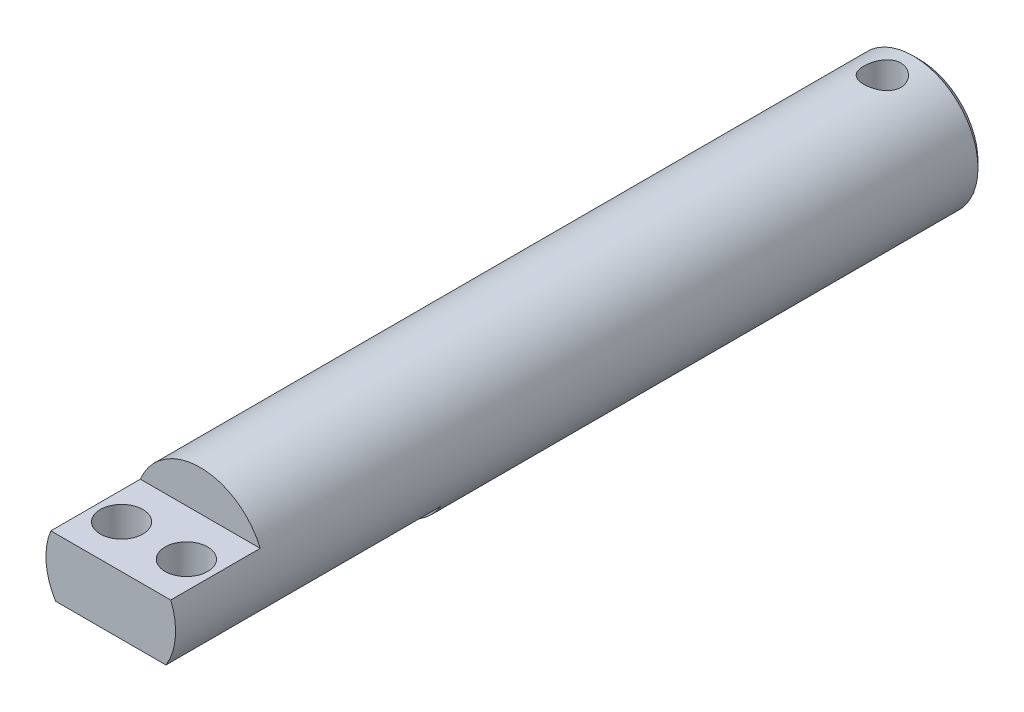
ISO-10303-21;
HEADER;
FILE_DESCRIPTION(('STEP AP214'),'2;1');
FILE_NAME('part.step','',(''),(''),'','','');
FILE_SCHEMA(('AUTOMOTIVE_DESIGN { 1 0 10303 214 1 1 1 1 }'));
ENDSEC;
DATA;
#1=APPLICATION_CONTEXT('core data for automotive mechanical design processes');
#2=APPLICATION_PROTOCOL_DEFINITION('international standard','automotive_design',2000,#1);
#3=PRODUCT_CONTEXT('',#1,'mechanical');
#4=PRODUCT('Part','Part','',(#3));
#5=PRODUCT_RELATED_PRODUCT_CATEGORY('part','',(#4));
#6=PRODUCT_DEFINITION_FORMATION('','',#4);
#7=PRODUCT_DEFINITION_CONTEXT('part definition',#1,'design');
#8=PRODUCT_DEFINITION('design','',#6,#7);
#9=PRODUCT_DEFINITION_SHAPE('','',#8);
#10=(LENGTH_UNIT() NAMED_UNIT(*) SI_UNIT(.MILLI.,.METRE.));
#11=(NAMED_UNIT(*) PLANE_ANGLE_UNIT() SI_UNIT($,.RADIAN.));
#12=(NAMED_UNIT(*) SI_UNIT($,.STERADIAN.) SOLID_ANGLE_UNIT());
#13=UNCERTAINTY_MEASURE_WITH_UNIT(LENGTH_MEASURE(1.E-05),#10,'distance_accuracy_value','');
#14=(GEOMETRIC_REPRESENTATION_CONTEXT(3) GLOBAL_UNCERTAINTY_ASSIGNED_CONTEXT((#13)) GLOBAL_UNIT_ASSIGNED_CONTEXT((#10,
#11,#12)) REPRESENTATION_CONTEXT('',''));
#15=CARTESIAN_POINT('',(0.,0.,0.));
#16=DIRECTION('',(0.,0.,1.));
#17=DIRECTION('',(1.,0.,0.));
#18=AXIS2_PLACEMENT_3D('',#15,#16,#17);
#19=CARTESIAN_POINT('',(0.,0.,131.));
#20=DIRECTION('',(0.,0.,-1.));
#21=DIRECTION('',(-1.,0.,0.));
#22=AXIS2_PLACEMENT_3D('',#19,#20,#21);
#23=CYLINDRICAL_SURFACE('',#22,10.5);
#24=CARTESIAN_POINT('',(0.,0.,1.));
#25=DIRECTION('',(0.,0.,1.));
#26=DIRECTION('',(1.,0.,0.));
#27=AXIS2_PLACEMENT_3D('',#24,#25,#26);
#28=CIRCLE('',#27,10.5);
#29=CARTESIAN_POINT('',(10.5,0.,1.));
#30=VERTEX_POINT('',#29);
#31=EDGE_CURVE('E39',#30,#30,#28,.T.);
#32=ORIENTED_EDGE('',*,*,#31,.T.);
#33=EDGE_LOOP('',(#32));
#34=FACE_BOUND('',#33,.T.);
#35=CARTESIAN_POINT('',(0.,-10.5,9.));
#36=CARTESIAN_POINT('',(0.164932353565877,-10.4999980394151,8.99999709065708));
#37=CARTESIAN_POINT('',(0.329894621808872,-10.4960762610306,8.98635331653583));
#38=CARTESIAN_POINT('',(0.655037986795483,-10.4808135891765,8.93225359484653));
#39=CARTESIAN_POINT('',(0.815217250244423,-10.4694698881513,8.89178750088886));
#40=CARTESIAN_POINT('',(1.12605645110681,-10.4406103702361,8.78548794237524));
#41=CARTESIAN_POINT('',(1.27672932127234,-10.4231031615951,8.71968984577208));
#42=CARTESIAN_POINT('',(1.56490314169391,-10.3837496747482,8.56473301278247));
#43=CARTESIAN_POINT('',(1.70240271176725,-10.3619029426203,8.47557183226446));
#44=CARTESIAN_POINT('',(1.96394167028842,-10.3155710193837,8.27394748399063));
#45=CARTESIAN_POINT('',(2.08758558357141,-10.2910356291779,8.16098286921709));
#46=CARTESIAN_POINT('',(2.31445703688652,-10.2424010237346,7.91602838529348));
#47=CARTESIAN_POINT('',(2.41768151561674,-10.2183018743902,7.78403566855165));
#48=CARTESIAN_POINT('',(2.60279685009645,-10.1727452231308,7.50150962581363));
#49=CARTESIAN_POINT('',(2.68421731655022,-10.1513505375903,7.3506570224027));
#50=CARTESIAN_POINT('',(2.82037755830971,-10.11437015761,7.03669198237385));
#51=CARTESIAN_POINT('',(2.87512307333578,-10.0987832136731,6.87358219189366));
#52=CARTESIAN_POINT('',(2.95497649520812,-10.0757041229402,6.54414785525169));
#53=CARTESIAN_POINT('',(2.98080829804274,-10.0680146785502,6.37801295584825));
#54=CARTESIAN_POINT('',(3.00436001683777,-10.0610131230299,6.04360327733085));
#55=CARTESIAN_POINT('',(3.00208604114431,-10.0616991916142,5.87532897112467));
#56=CARTESIAN_POINT('',(2.97006202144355,-10.071195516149,5.54719708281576));
#57=CARTESIAN_POINT('',(2.94120488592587,-10.079741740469,5.38724347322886));
#58=CARTESIAN_POINT('',(2.85827079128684,-10.1035702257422,5.07454917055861));
#59=CARTESIAN_POINT('',(2.80419155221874,-10.1188530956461,4.92180913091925));
#60=CARTESIAN_POINT('',(2.67166021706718,-10.1546529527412,4.62563063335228));
#61=CARTESIAN_POINT('',(2.59290826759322,-10.1752337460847,4.48233439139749));
#62=CARTESIAN_POINT('',(2.41347568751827,-10.2192782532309,4.21068515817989));
#63=CARTESIAN_POINT('',(2.31279017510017,-10.2427426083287,4.08233550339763));
#64=CARTESIAN_POINT('',(2.08785599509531,-10.2909937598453,3.83914143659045));
#65=CARTESIAN_POINT('',(1.96286231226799,-10.3157970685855,3.72498828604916));
#66=CARTESIAN_POINT('',(1.69519842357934,-10.3631437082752,3.51911099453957));
#67=CARTESIAN_POINT('',(1.55252730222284,-10.3856869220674,3.42738801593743));
#68=CARTESIAN_POINT('',(1.25238460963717,-10.4261479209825,3.26860689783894));
#69=CARTESIAN_POINT('',(1.09483472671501,-10.4440391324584,3.20168956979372));
#70=CARTESIAN_POINT('',(0.770089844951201,-10.4729887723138,3.09549916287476));
#71=CARTESIAN_POINT('',(0.602897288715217,-10.4840489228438,3.05621911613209));
#72=CARTESIAN_POINT('',(0.269499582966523,-10.4978231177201,3.00754007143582));
#73=CARTESIAN_POINT('',(0.103442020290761,-10.500799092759,2.99720295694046));
#74=CARTESIAN_POINT('',(-0.228039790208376,-10.4988312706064,3.00409089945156));
#75=CARTESIAN_POINT('',(-0.393464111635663,-10.4938884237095,3.02131264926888));
#76=CARTESIAN_POINT('',(-0.715527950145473,-10.4768089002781,3.08206566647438));
#77=CARTESIAN_POINT('',(-0.872277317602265,-10.4648191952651,3.12505977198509));
#78=CARTESIAN_POINT('',(-1.17631302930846,-10.4350199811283,3.23550075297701));
#79=CARTESIAN_POINT('',(-1.32359827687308,-10.4172097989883,3.302950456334));
#80=CARTESIAN_POINT('',(-1.60806252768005,-10.377149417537,3.46203500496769));
#81=CARTESIAN_POINT('',(-1.74495372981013,-10.3548114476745,3.55416179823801));
#82=CARTESIAN_POINT('',(-2.00165779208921,-10.3082692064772,3.75937875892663));
#83=CARTESIAN_POINT('',(-2.12146675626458,-10.2840645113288,3.87247369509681));
#84=CARTESIAN_POINT('',(-2.34465964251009,-10.2355292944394,4.1208140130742));
#85=CARTESIAN_POINT('',(-2.44737814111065,-10.211220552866,4.25666291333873));
#86=CARTESIAN_POINT('',(-2.6285929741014,-10.1660834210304,4.54419388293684));
#87=CARTESIAN_POINT('',(-2.70709015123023,-10.1452549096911,4.6958754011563));
#88=CARTESIAN_POINT('',(-2.83706181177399,-10.1096797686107,5.01013681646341));
#89=CARTESIAN_POINT('',(-2.88867949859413,-10.094901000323,5.17265364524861));
#90=CARTESIAN_POINT('',(-2.96369175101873,-10.0731368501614,5.50456490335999));
#91=CARTESIAN_POINT('',(-2.98709486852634,-10.0661491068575,5.67395723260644));
#92=CARTESIAN_POINT('',(-3.00447036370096,-10.0609755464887,6.00794404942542));
#93=CARTESIAN_POINT('',(-2.99952041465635,-10.0624674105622,6.17247825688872));
#94=CARTESIAN_POINT('',(-2.96287066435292,-10.0733189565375,6.49826209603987));
#95=CARTESIAN_POINT('',(-2.93117175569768,-10.0826783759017,6.65951183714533));
#96=CARTESIAN_POINT('',(-2.84258953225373,-10.1080046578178,6.97256755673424));
#97=CARTESIAN_POINT('',(-2.78596637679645,-10.1239031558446,7.12445308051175));
#98=CARTESIAN_POINT('',(-2.64934423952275,-10.1605095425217,7.4166881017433));
#99=CARTESIAN_POINT('',(-2.56934112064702,-10.181218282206,7.5570355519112));
#100=CARTESIAN_POINT('',(-2.3850981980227,-10.2259750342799,7.82727528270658));
#101=CARTESIAN_POINT('',(-2.28013841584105,-10.2501114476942,7.95666208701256));
#102=CARTESIAN_POINT('',(-2.05028976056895,-10.2985476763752,8.1963358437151));
#103=CARTESIAN_POINT('',(-1.92539587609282,-10.3228475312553,8.30661797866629));
#104=CARTESIAN_POINT('',(-1.65536148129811,-10.3696193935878,8.50775577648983));
#105=CARTESIAN_POINT('',(-1.50978375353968,-10.3920285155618,8.59804048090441));
#106=CARTESIAN_POINT('',(-1.20487579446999,-10.4317709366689,8.75271867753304));
#107=CARTESIAN_POINT('',(-1.04555313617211,-10.4491070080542,8.8171263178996));
#108=CARTESIAN_POINT('',(-0.739374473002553,-10.4749101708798,8.91127132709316));
#109=CARTESIAN_POINT('',(-0.593644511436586,-10.4842452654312,8.94446030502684));
#110=CARTESIAN_POINT('',(-0.298617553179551,-10.4967906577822,8.98882448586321));
#111=CARTESIAN_POINT('',(-0.149321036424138,-10.5000017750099,9.00000263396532));
#112=CARTESIAN_POINT('',(0.,-10.5,9.));
#113=B_SPLINE_CURVE_WITH_KNOTS('',3,(#35,#36,#37,#38,#39,#40,#41,#42,#43,#44,#45,#46,#47,#48,
#49,#50,#51,#52,#53,#54,#55,#56,#57,#58,#59,#60,#61,#62,#63,#64,#65,#66,#67,#68,#69,#70,#71,#72,
#73,#74,#75,#76,#77,#78,#79,#80,#81,#82,#83,#84,#85,#86,#87,#88,#89,#90,#91,#92,#93,#94,#95,#96,
#97,#98,#99,#100,#101,#102,#103,#104,#105,#106,#107,#108,#109,#110,#111,#112),.UNSPECIFIED.,.T.,
.F.,(4,2,2,2,2,2,2,2,2,2,2,2,2,2,2,2,2,2,2,2,2,2,2,2,2,2,2,2,2,2,2,2,2,2,2,2,2,2,4),(0.,
0.494248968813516,0.98868500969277,1.48243321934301,1.97623310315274,2.48171717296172,
2.9872769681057,3.50299612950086,4.01860427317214,4.52099264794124,5.02327183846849,
5.50927178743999,5.99531567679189,6.48751204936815,6.97981808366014,7.49067750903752,
8.00156340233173,8.51530651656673,9.02892006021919,9.52568186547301,10.0223840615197,
10.5090771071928,10.9958264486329,11.4931128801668,11.9905125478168,12.504181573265,
13.0178327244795,13.5287186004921,14.039449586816,14.5309002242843,15.0223344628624,
15.5087564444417,15.9952645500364,16.4980148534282,17.0008917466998,17.5166696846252,
18.0321652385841,18.4796920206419,18.9271589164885),.UNSPECIFIED.);
#114=CARTESIAN_POINT('',(0.,-10.5,9.));
#115=VERTEX_POINT('',#114);
#116=EDGE_CURVE('E94',#115,#115,#113,.T.);
#117=ORIENTED_EDGE('',*,*,#116,.T.);
#118=EDGE_LOOP('',(#117));
#119=FACE_BOUND('',#118,.T.);
#120=CARTESIAN_POINT('',(0.,10.5,9.));
#121=CARTESIAN_POINT('',(-0.164932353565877,10.4999980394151,8.99999709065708));
#122=CARTESIAN_POINT('',(-0.329894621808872,10.4960762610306,8.98635331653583));
#123=CARTESIAN_POINT('',(-0.655037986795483,10.4808135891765,8.93225359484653));
#124=CARTESIAN_POINT('',(-0.815217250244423,10.4694698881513,8.89178750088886));
#125=CARTESIAN_POINT('',(-1.12605645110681,10.4406103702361,8.78548794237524));
#126=CARTESIAN_POINT('',(-1.27672932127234,10.4231031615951,8.71968984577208));
#127=CARTESIAN_POINT('',(-1.56490314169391,10.3837496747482,8.56473301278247));
#128=CARTESIAN_POINT('',(-1.70240271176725,10.3619029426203,8.47557183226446));
#129=CARTESIAN_POINT('',(-1.96394167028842,10.3155710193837,8.27394748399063));
#130=CARTESIAN_POINT('',(-2.08758558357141,10.2910356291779,8.16098286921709));
#131=CARTESIAN_POINT('',(-2.31445703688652,10.2424010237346,7.91602838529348));
#132=CARTESIAN_POINT('',(-2.41768151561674,10.2183018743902,7.78403566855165));
#133=CARTESIAN_POINT('',(-2.60279685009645,10.1727452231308,7.50150962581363));
#134=CARTESIAN_POINT('',(-2.68421731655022,10.1513505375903,7.3506570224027));
#135=CARTESIAN_POINT('',(-2.82037755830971,10.11437015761,7.03669198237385));
#136=CARTESIAN_POINT('',(-2.87512307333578,10.0987832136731,6.87358219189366));
#137=CARTESIAN_POINT('',(-2.95497649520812,10.0757041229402,6.54414785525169));
#138=CARTESIAN_POINT('',(-2.98080829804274,10.0680146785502,6.37801295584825));
#139=CARTESIAN_POINT('',(-3.00436001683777,10.0610131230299,6.04360327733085));
#140=CARTESIAN_POINT('',(-3.00208604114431,10.0616991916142,5.87532897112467));
#141=CARTESIAN_POINT('',(-2.97006202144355,10.071195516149,5.54719708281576));
#142=CARTESIAN_POINT('',(-2.94120488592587,10.079741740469,5.38724347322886));
#143=CARTESIAN_POINT('',(-2.85827079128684,10.1035702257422,5.07454917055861));
#144=CARTESIAN_POINT('',(-2.80419155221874,10.1188530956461,4.92180913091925));
#145=CARTESIAN_POINT('',(-2.67166021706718,10.1546529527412,4.62563063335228));
#146=CARTESIAN_POINT('',(-2.59290826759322,10.1752337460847,4.48233439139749));
#147=CARTESIAN_POINT('',(-2.41347568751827,10.2192782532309,4.21068515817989));
#148=CARTESIAN_POINT('',(-2.31279017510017,10.2427426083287,4.08233550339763));
#149=CARTESIAN_POINT('',(-2.08785599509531,10.2909937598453,3.83914143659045));
#150=CARTESIAN_POINT('',(-1.96286231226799,10.3157970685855,3.72498828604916));
#151=CARTESIAN_POINT('',(-1.69519842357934,10.3631437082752,3.51911099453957));
#152=CARTESIAN_POINT('',(-1.55252730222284,10.3856869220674,3.42738801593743));
#153=CARTESIAN_POINT('',(-1.25238460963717,10.4261479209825,3.26860689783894));
#154=CARTESIAN_POINT('',(-1.09483472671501,10.4440391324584,3.20168956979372));
#155=CARTESIAN_POINT('',(-0.770089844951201,10.4729887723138,3.09549916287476));
#156=CARTESIAN_POINT('',(-0.602897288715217,10.4840489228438,3.05621911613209));
#157=CARTESIAN_POINT('',(-0.269499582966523,10.4978231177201,3.00754007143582));
#158=CARTESIAN_POINT('',(-0.103442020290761,10.500799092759,2.99720295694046));
#159=CARTESIAN_POINT('',(0.228039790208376,10.4988312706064,3.00409089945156));
#160=CARTESIAN_POINT('',(0.393464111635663,10.4938884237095,3.02131264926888));
#161=CARTESIAN_POINT('',(0.715527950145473,10.4768089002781,3.08206566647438));
#162=CARTESIAN_POINT('',(0.872277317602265,10.4648191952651,3.12505977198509));
#163=CARTESIAN_POINT('',(1.17631302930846,10.4350199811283,3.23550075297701));
#164=CARTESIAN_POINT('',(1.32359827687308,10.4172097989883,3.302950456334));
#165=CARTESIAN_POINT('',(1.60806252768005,10.377149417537,3.46203500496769));
#166=CARTESIAN_POINT('',(1.74495372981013,10.3548114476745,3.55416179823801));
#167=CARTESIAN_POINT('',(2.00165779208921,10.3082692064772,3.75937875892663));
#168=CARTESIAN_POINT('',(2.12146675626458,10.2840645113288,3.87247369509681));
#169=CARTESIAN_POINT('',(2.34465964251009,10.2355292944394,4.1208140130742));
#170=CARTESIAN_POINT('',(2.44737814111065,10.211220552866,4.25666291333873));
#171=CARTESIAN_POINT('',(2.6285929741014,10.1660834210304,4.54419388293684));
#172=CARTESIAN_POINT('',(2.70709015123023,10.1452549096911,4.6958754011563));
#173=CARTESIAN_POINT('',(2.83706181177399,10.1096797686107,5.01013681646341));
#174=CARTESIAN_POINT('',(2.88867949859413,10.094901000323,5.17265364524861));
#175=CARTESIAN_POINT('',(2.96369175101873,10.0731368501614,5.50456490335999));
#176=CARTESIAN_POINT('',(2.98709486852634,10.0661491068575,5.67395723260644));
#177=CARTESIAN_POINT('',(3.00447036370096,10.0609755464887,6.00794404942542));
#178=CARTESIAN_POINT('',(2.99952041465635,10.0624674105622,6.17247825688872));
#179=CARTESIAN_POINT('',(2.96287066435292,10.0733189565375,6.49826209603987));
#180=CARTESIAN_POINT('',(2.93117175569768,10.0826783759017,6.65951183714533));
#181=CARTESIAN_POINT('',(2.84258953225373,10.1080046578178,6.97256755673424));
#182=CARTESIAN_POINT('',(2.78596637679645,10.1239031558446,7.12445308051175));
#183=CARTESIAN_POINT('',(2.64934423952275,10.1605095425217,7.4166881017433));
#184=CARTESIAN_POINT('',(2.56934112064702,10.181218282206,7.5570355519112));
#185=CARTESIAN_POINT('',(2.3850981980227,10.2259750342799,7.82727528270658));
#186=CARTESIAN_POINT('',(2.28013841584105,10.2501114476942,7.95666208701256));
#187=CARTESIAN_POINT('',(2.05028976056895,10.2985476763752,8.1963358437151));
#188=CARTESIAN_POINT('',(1.92539587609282,10.3228475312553,8.30661797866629));
#189=CARTESIAN_POINT('',(1.65536148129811,10.3696193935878,8.50775577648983));
#190=CARTESIAN_POINT('',(1.50978375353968,10.3920285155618,8.59804048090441));
#191=CARTESIAN_POINT('',(1.20487579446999,10.4317709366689,8.75271867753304));
#192=CARTESIAN_POINT('',(1.04555313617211,10.4491070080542,8.8171263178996));
#193=CARTESIAN_POINT('',(0.739374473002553,10.4749101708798,8.91127132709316));
#194=CARTESIAN_POINT('',(0.593644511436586,10.4842452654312,8.94446030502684));
#195=CARTESIAN_POINT('',(0.298617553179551,10.4967906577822,8.98882448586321));
#196=CARTESIAN_POINT('',(0.149321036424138,10.5000017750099,9.00000263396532));
#197=CARTESIAN_POINT('',(0.,10.5,9.));
#198=B_SPLINE_CURVE_WITH_KNOTS('',3,(#120,#121,#122,#123,#124,#125,#126,#127,#128,#129,#130,
#131,#132,#133,#134,#135,#136,#137,#138,#139,#140,#141,#142,#143,#144,#145,#146,#147,#148,#149,
#150,#151,#152,#153,#154,#155,#156,#157,#158,#159,#160,#161,#162,#163,#164,#165,#166,#167,#168,
#169,#170,#171,#172,#173,#174,#175,#176,#177,#178,#179,#180,#181,#182,#183,#184,#185,#186,#187,
#188,#189,#190,#191,#192,#193,#194,#195,#196,#197),.UNSPECIFIED.,.T.,.F.,(4,2,2,2,2,2,2,2,2,2,2,
2,2,2,2,2,2,2,2,2,2,2,2,2,2,2,2,2,2,2,2,2,2,2,2,2,2,2,4),(0.,0.494248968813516,0.98868500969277,
1.48243321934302,1.97623310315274,2.48171717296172,2.9872769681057,3.50299612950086,
4.01860427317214,4.52099264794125,5.0232718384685,5.50927178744,5.99531567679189,
6.48751204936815,6.97981808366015,7.49067750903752,8.00156340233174,8.51530651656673,
9.02892006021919,9.52568186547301,10.0223840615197,10.5090771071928,10.9958264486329,
11.4931128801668,11.9905125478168,12.504181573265,13.0178327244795,13.5287186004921,
14.039449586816,14.5309002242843,15.0223344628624,15.5087564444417,15.9952645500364,
16.4980148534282,17.0008917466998,17.5166696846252,18.0321652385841,18.4796920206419,
18.9271589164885),.UNSPECIFIED.);
#199=CARTESIAN_POINT('',(0.,10.5,9.));
#200=VERTEX_POINT('',#199);
#201=EDGE_CURVE('E90',#200,#200,#198,.T.);
#202=ORIENTED_EDGE('',*,*,#201,.T.);
#203=EDGE_LOOP('',(#202));
#204=FACE_BOUND('',#203,.T.);
#205=CARTESIAN_POINT('',(0.,0.,131.));
#206=DIRECTION('',(0.,0.,1.));
#207=DIRECTION('',(1.,0.,0.));
#208=AXIS2_PLACEMENT_3D('',#205,#206,#207);
#209=CIRCLE('',#208,10.5);
#210=CARTESIAN_POINT('',(8.94427190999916,-5.5,131.));
#211=VERTEX_POINT('',#210);
#212=CARTESIAN_POINT('',(9.7082439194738,4.,131.));
#213=VERTEX_POINT('',#212);
#214=EDGE_CURVE('E91',#211,#213,#209,.T.);
#215=ORIENTED_EDGE('',*,*,#214,.F.);
#216=DIRECTION('',(0.,0.,1.));
#217=VECTOR('',#216,1.);
#218=CARTESIAN_POINT('',(8.94427190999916,-5.5,86.5));
#219=LINE('',#218,#217);
#220=CARTESIAN_POINT('',(8.94427190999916,-5.5,86.5));
#221=VERTEX_POINT('',#220);
#222=EDGE_CURVE('E46',#221,#211,#219,.T.);
#223=ORIENTED_EDGE('',*,*,#222,.F.);
#224=CARTESIAN_POINT('',(0.,0.,86.5));
#225=DIRECTION('',(0.,0.,1.));
#226=DIRECTION('',(1.,0.,0.));
#227=AXIS2_PLACEMENT_3D('',#224,#225,#226);
#228=CIRCLE('',#227,10.5);
#229=CARTESIAN_POINT('',(-8.94427190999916,-5.5,86.5));
#230=VERTEX_POINT('',#229);
#231=EDGE_CURVE('E80',#230,#221,#228,.T.);
#232=ORIENTED_EDGE('',*,*,#231,.F.);
#233=DIRECTION('',(0.,0.,1.));
#234=VECTOR('',#233,1.);
#235=CARTESIAN_POINT('',(-8.94427190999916,-5.5,86.5));
#236=LINE('',#235,#234);
#237=CARTESIAN_POINT('',(-8.94427190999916,-5.5,131.));
#238=VERTEX_POINT('',#237);
#239=EDGE_CURVE('E75',#230,#238,#236,.T.);
#240=ORIENTED_EDGE('',*,*,#239,.T.);
#241=CARTESIAN_POINT('',(-9.7082439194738,4.,131.));
#242=VERTEX_POINT('',#241);
#243=EDGE_CURVE('E86',#242,#238,#209,.T.);
#244=ORIENTED_EDGE('',*,*,#243,.F.);
#245=DIRECTION('',(0.,0.,1.));
#246=VECTOR('',#245,1.);
#247=CARTESIAN_POINT('',(-9.7082439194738,4.,116.5));
#248=LINE('',#247,#246);
#249=CARTESIAN_POINT('',(-9.7082439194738,4.,116.5));
#250=VERTEX_POINT('',#249);
#251=EDGE_CURVE('E54',#250,#242,#248,.T.);
#252=ORIENTED_EDGE('',*,*,#251,.F.);
#253=CARTESIAN_POINT('',(0.,0.,116.5));
#254=DIRECTION('',(0.,0.,1.));
#255=DIRECTION('',(1.,0.,0.));
#256=AXIS2_PLACEMENT_3D('',#253,#254,#255);
#257=CIRCLE('',#256,10.5);
#258=CARTESIAN_POINT('',(9.7082439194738,4.,116.5));
#259=VERTEX_POINT('',#258);
#260=EDGE_CURVE('E234',#259,#250,#257,.T.);
#261=ORIENTED_EDGE('',*,*,#260,.F.);
#262=DIRECTION('',(0.,0.,1.));
#263=VECTOR('',#262,1.);
#264=CARTESIAN_POINT('',(9.7082439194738,4.,116.5));
#265=LINE('',#264,#263);
#266=EDGE_CURVE('E96',#259,#213,#265,.T.);
#267=ORIENTED_EDGE('',*,*,#266,.T.);
#268=EDGE_LOOP('',(#215,#223,#232,#240,#244,#252,#261,#267));
#269=FACE_BOUND('',#268,.T.);
#270=ADVANCED_FACE('F31',(#34,#119,#204,#269),#23,.T.);
#271=CARTESIAN_POINT('',(0.,0.,131.));
#272=DIRECTION('',(0.,0.,1.));
#273=DIRECTION('',(1.,0.,0.));
#274=AXIS2_PLACEMENT_3D('',#271,#272,#273);
#275=PLANE('',#274);
#276=DIRECTION('',(-1.,0.,0.));
#277=VECTOR('',#276,1.);
#278=CARTESIAN_POINT('',(-8.94427190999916,-5.5,131.));
#279=LINE('',#278,#277);
#280=EDGE_CURVE('E72',#211,#238,#279,.T.);
#281=ORIENTED_EDGE('',*,*,#280,.F.);
#282=ORIENTED_EDGE('',*,*,#214,.T.);
#283=DIRECTION('',(1.,0.,0.));
#284=VECTOR('',#283,1.);
#285=CARTESIAN_POINT('',(-9.7082439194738,4.,131.));
#286=LINE('',#285,#284);
#287=EDGE_CURVE('E87',#242,#213,#286,.T.);
#288=ORIENTED_EDGE('',*,*,#287,.F.);
#289=ORIENTED_EDGE('',*,*,#243,.T.);
#290=EDGE_LOOP('',(#281,#282,#288,#289));
#291=FACE_BOUND('',#290,.T.);
#292=ADVANCED_FACE('F89',(#291),#275,.T.);
#293=CARTESIAN_POINT('',(0.,0.,0.));
#294=DIRECTION('',(0.,0.,1.));
#295=DIRECTION('',(1.,0.,0.));
#296=AXIS2_PLACEMENT_3D('',#293,#294,#295);
#297=PLANE('',#296);
#298=CARTESIAN_POINT('',(0.,0.,0.));
#299=DIRECTION('',(0.,0.,1.));
#300=DIRECTION('',(1.,0.,0.));
#301=AXIS2_PLACEMENT_3D('',#298,#299,#300);
#302=CIRCLE('',#301,9.5);
#303=CARTESIAN_POINT('',(9.5,0.,0.));
#304=VERTEX_POINT('',#303);
#305=EDGE_CURVE('E11',#304,#304,#302,.F.);
#306=ORIENTED_EDGE('',*,*,#305,.T.);
#307=EDGE_LOOP('',(#306));
#308=FACE_BOUND('',#307,.T.);
#309=ADVANCED_FACE('F142',(#308),#297,.F.);
#310=CARTESIAN_POINT('',(-9.7082439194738,4.,116.5));
#311=DIRECTION('',(0.,-1.,0.));
#312=DIRECTION('',(0.,0.,-1.));
#313=AXIS2_PLACEMENT_3D('',#310,#311,#312);
#314=PLANE('',#313);
#315=CARTESIAN_POINT('',(-5.25,4.,124.));
#316=DIRECTION('',(0.,1.,0.));
#317=DIRECTION('',(0.,0.,-1.));
#318=AXIS2_PLACEMENT_3D('',#315,#316,#317);
#319=CIRCLE('',#318,3.45);
#320=CARTESIAN_POINT('',(-5.25,4.,120.55));
#321=VERTEX_POINT('',#320);
#322=EDGE_CURVE('E105',#321,#321,#319,.T.);
#323=ORIENTED_EDGE('',*,*,#322,.F.);
#324=EDGE_LOOP('',(#323));
#325=FACE_BOUND('',#324,.T.);
#326=CARTESIAN_POINT('',(5.25,4.,124.));
#327=DIRECTION('',(0.,1.,0.));
#328=DIRECTION('',(0.,0.,1.));
#329=AXIS2_PLACEMENT_3D('',#326,#327,#328);
#330=CIRCLE('',#329,3.45);
#331=CARTESIAN_POINT('',(5.25,4.,127.45));
#332=VERTEX_POINT('',#331);
#333=EDGE_CURVE('E102',#332,#332,#330,.T.);
#334=ORIENTED_EDGE('',*,*,#333,.F.);
#335=EDGE_LOOP('',(#334));
#336=FACE_BOUND('',#335,.T.);
#337=ORIENTED_EDGE('',*,*,#287,.T.);
#338=ORIENTED_EDGE('',*,*,#266,.F.);
#339=DIRECTION('',(1.,0.,0.));
#340=VECTOR('',#339,1.);
#341=CARTESIAN_POINT('',(-9.7082439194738,4.,116.5));
#342=LINE('',#341,#340);
#343=EDGE_CURVE('E237',#250,#259,#342,.T.);
#344=ORIENTED_EDGE('',*,*,#343,.F.);
#345=ORIENTED_EDGE('',*,*,#251,.T.);
#346=EDGE_LOOP('',(#337,#338,#344,#345));
#347=FACE_BOUND('',#346,.T.);
#348=ADVANCED_FACE('F138',(#325,#336,#347),#314,.F.);
#349=CARTESIAN_POINT('',(0.,0.,116.5));
#350=DIRECTION('',(0.,0.,1.));
#351=DIRECTION('',(1.,0.,0.));
#352=AXIS2_PLACEMENT_3D('',#349,#350,#351);
#353=PLANE('',#352);
#354=ORIENTED_EDGE('',*,*,#260,.T.);
#355=ORIENTED_EDGE('',*,*,#343,.T.);
#356=EDGE_LOOP('',(#354,#355));
#357=FACE_BOUND('',#356,.T.);
#358=ADVANCED_FACE('F134',(#357),#353,.T.);
#359=CARTESIAN_POINT('',(-8.94427190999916,-5.5,86.5));
#360=DIRECTION('',(0.,1.,0.));
#361=DIRECTION('',(0.,0.,1.));
#362=AXIS2_PLACEMENT_3D('',#359,#360,#361);
#363=PLANE('',#362);
#364=CARTESIAN_POINT('',(-5.25,-5.5,124.));
#365=DIRECTION('',(0.,1.,0.));
#366=DIRECTION('',(0.,0.,1.));
#367=AXIS2_PLACEMENT_3D('',#364,#365,#366);
#368=CIRCLE('',#367,3.45);
#369=CARTESIAN_POINT('',(-5.25,-5.5,127.45));
#370=VERTEX_POINT('',#369);
#371=EDGE_CURVE('E103',#370,#370,#368,.T.);
#372=ORIENTED_EDGE('',*,*,#371,.T.);
#373=EDGE_LOOP('',(#372));
#374=FACE_BOUND('',#373,.T.);
#375=CARTESIAN_POINT('',(5.25,-5.5,124.));
#376=DIRECTION('',(0.,1.,0.));
#377=DIRECTION('',(0.,0.,1.));
#378=AXIS2_PLACEMENT_3D('',#375,#376,#377);
#379=CIRCLE('',#378,3.45);
#380=CARTESIAN_POINT('',(5.25,-5.5,127.45));
#381=VERTEX_POINT('',#380);
#382=EDGE_CURVE('E81',#381,#381,#379,.T.);
#383=ORIENTED_EDGE('',*,*,#382,.T.);
#384=EDGE_LOOP('',(#383));
#385=FACE_BOUND('',#384,.T.);
#386=ORIENTED_EDGE('',*,*,#280,.T.);
#387=ORIENTED_EDGE('',*,*,#239,.F.);
#388=DIRECTION('',(-1.,0.,0.));
#389=VECTOR('',#388,1.);
#390=CARTESIAN_POINT('',(-8.94427190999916,-5.5,86.5));
#391=LINE('',#390,#389);
#392=EDGE_CURVE('E241',#221,#230,#391,.T.);
#393=ORIENTED_EDGE('',*,*,#392,.F.);
#394=ORIENTED_EDGE('',*,*,#222,.T.);
#395=EDGE_LOOP('',(#386,#387,#393,#394));
#396=FACE_BOUND('',#395,.T.);
#397=ADVANCED_FACE('F74',(#374,#385,#396),#363,.F.);
#398=CARTESIAN_POINT('',(0.,0.,86.5));
#399=DIRECTION('',(0.,0.,1.));
#400=DIRECTION('',(1.,0.,0.));
#401=AXIS2_PLACEMENT_3D('',#398,#399,#400);
#402=PLANE('',#401);
#403=ORIENTED_EDGE('',*,*,#231,.T.);
#404=ORIENTED_EDGE('',*,*,#392,.T.);
#405=EDGE_LOOP('',(#403,#404));
#406=FACE_BOUND('',#405,.T.);
#407=ADVANCED_FACE('F127',(#406),#402,.T.);
#408=CARTESIAN_POINT('',(5.25,-10.5,124.));
#409=DIRECTION('',(0.,1.,0.));
#410=DIRECTION('',(0.,0.,1.));
#411=AXIS2_PLACEMENT_3D('',#408,#409,#410);
#412=CYLINDRICAL_SURFACE('',#411,3.45);
#413=ORIENTED_EDGE('',*,*,#333,.T.);
#414=EDGE_LOOP('',(#413));
#415=FACE_BOUND('',#414,.T.);
#416=ORIENTED_EDGE('',*,*,#382,.F.);
#417=EDGE_LOOP('',(#416));
#418=FACE_BOUND('',#417,.T.);
#419=ADVANCED_FACE('F123',(#415,#418),#412,.F.);
#420=CARTESIAN_POINT('',(-5.25,-10.5,124.));
#421=DIRECTION('',(0.,1.,0.));
#422=DIRECTION('',(0.,0.,1.));
#423=AXIS2_PLACEMENT_3D('',#420,#421,#422);
#424=CYLINDRICAL_SURFACE('',#423,3.45);
#425=ORIENTED_EDGE('',*,*,#322,.T.);
#426=EDGE_LOOP('',(#425));
#427=FACE_BOUND('',#426,.T.);
#428=ORIENTED_EDGE('',*,*,#371,.F.);
#429=EDGE_LOOP('',(#428));
#430=FACE_BOUND('',#429,.T.);
#431=ADVANCED_FACE('F118',(#427,#430),#424,.F.);
#432=CARTESIAN_POINT('',(0.,-10.5,6.));
#433=DIRECTION('',(0.,1.,0.));
#434=DIRECTION('',(0.,0.,1.));
#435=AXIS2_PLACEMENT_3D('',#432,#433,#434);
#436=CYLINDRICAL_SURFACE('',#435,3.);
#437=ORIENTED_EDGE('',*,*,#201,.F.);
#438=EDGE_LOOP('',(#437));
#439=FACE_BOUND('',#438,.T.);
#440=ORIENTED_EDGE('',*,*,#116,.F.);
#441=EDGE_LOOP('',(#440));
#442=FACE_BOUND('',#441,.T.);
#443=ADVANCED_FACE('F112',(#439,#442),#436,.F.);
#444=CARTESIAN_POINT('',(0.,0.,1.));
#445=DIRECTION('',(0.,0.,1.));
#446=DIRECTION('',(1.,0.,0.));
#447=AXIS2_PLACEMENT_3D('',#444,#445,#446);
#448=CONICAL_SURFACE('',#447,10.5,0.78539816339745);
#449=ORIENTED_EDGE('',*,*,#305,.F.);
#450=EDGE_LOOP('',(#449));
#451=FACE_BOUND('',#450,.T.);
#452=ORIENTED_EDGE('',*,*,#31,.F.);
#453=EDGE_LOOP('',(#452));
#454=FACE_BOUND('',#453,.T.);
#455=ADVANCED_FACE('F117',(#451,#454),#448,.T.);
#456=CLOSED_SHELL('',(#270,#292,#309,#348,#358,#397,#407,#419,#431,#443,#455));
#457=MANIFOLD_SOLID_BREP('B2',#456);
#458=ADVANCED_BREP_SHAPE_REPRESENTATION('',(#18,#457),#14);
#459=SHAPE_DEFINITION_REPRESENTATION(#9,#458);
ENDSEC;
END-ISO-10303-21;
